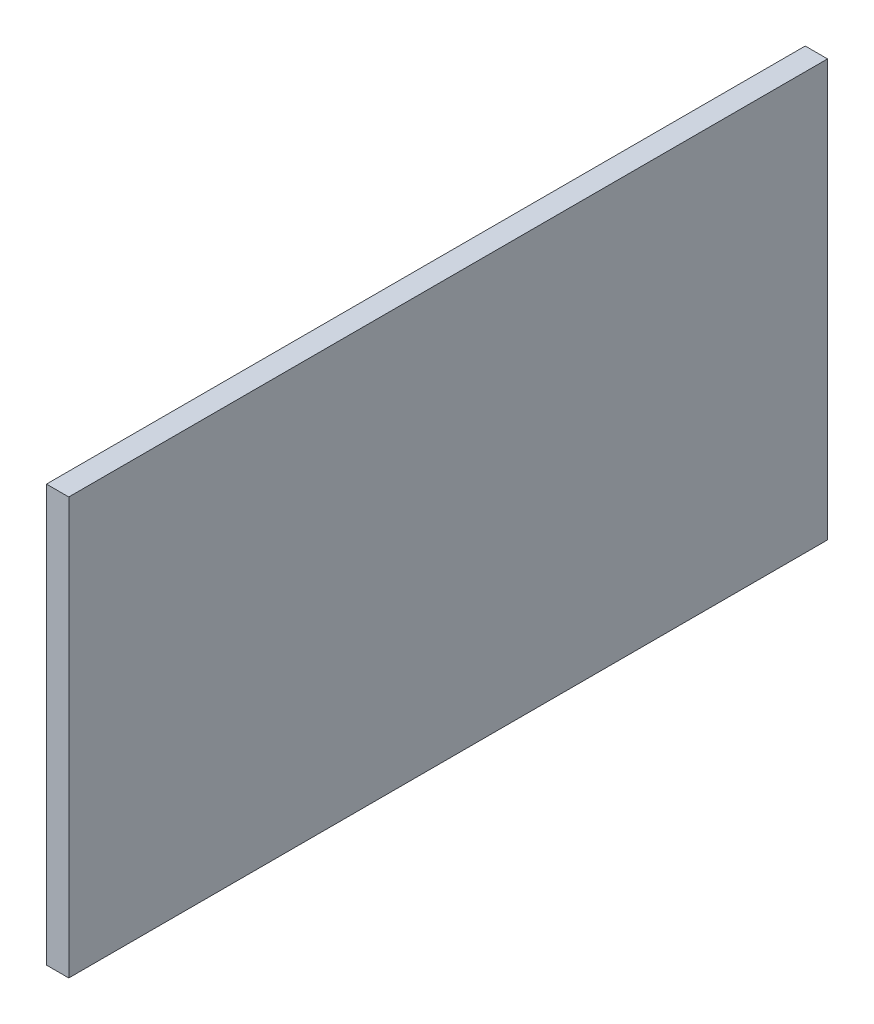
from build123d import *

# Parameters (mm, degrees)
SKETCH1_W      = 19.05
SKETCH1_H      = 355.6
EXTRUDE1_DEPTH = 647.7


with BuildPart() as part:
    # Sketch1 → Extrude1 (new body)
    with BuildSketch(Plane.XY):
        with Locations((9.525, 177.8)):
            Rectangle(SKETCH1_W, SKETCH1_H)
    extrude(amount=EXTRUDE1_DEPTH)


solid = part.part
